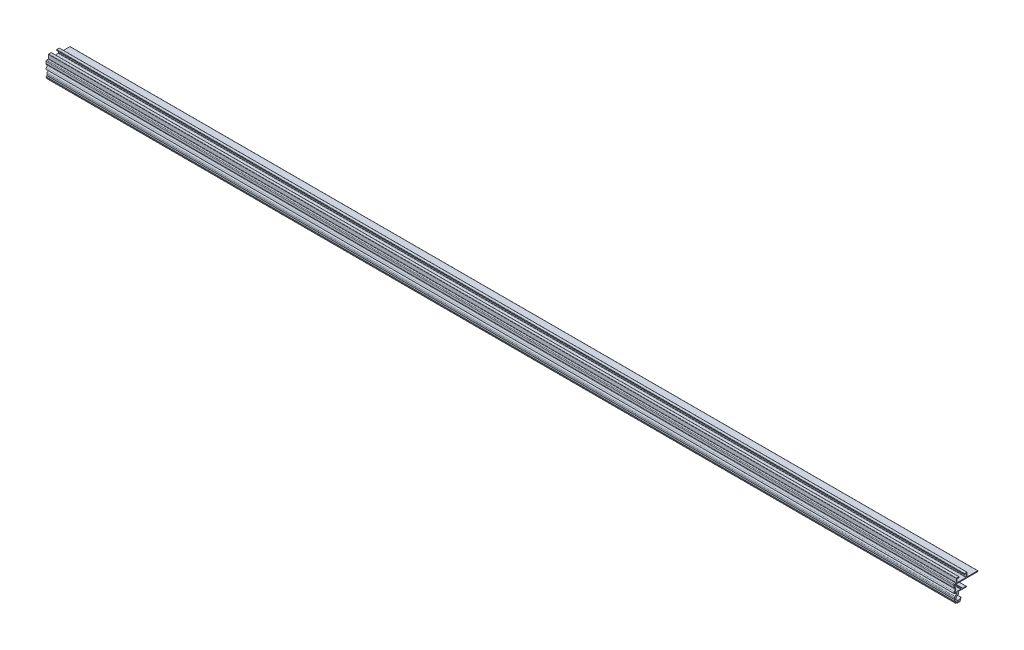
from build123d import *

# Parameters (mm, degrees)
BOSS_EXTRU_1_DEPTH = 1087


with BuildPart() as part:
    # Esquisse1 → Boss.-Extru.1 (new body)
    with BuildSketch(Plane(origin=(0, 0, 0), x_dir=(0, 0, -1), z_dir=(1, 0, 0))):
        with BuildLine():
            Line((11.5, -12.657081), (11.5, -12.857081))
            ThreePointArc((11.5, -12.857081), (11.382842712, -13.139923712), (11.1, -13.257081))
            Line((11.1, -13.257081), (2, -13.257081))
            Line((2, -13.257081), (2, -16.408499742))
            ThreePointArc((2, -16.408499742), (-0.258474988, -20.871875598), (4.717577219, -20.360663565))
            ThreePointArc((4.717577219, -20.360663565), (4.819997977, -20.299909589), (4.907922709, -20.380223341))
            Line((4.907922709, -20.380223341), (5.057433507, -21.145993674))
            Line((5.057433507, -21.145993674), (4.450801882, -22.977983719))
            Line((4.450801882, -22.977983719), (3.699511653, -24.650639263))
            ThreePointArc((3.699511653, -24.650639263), (3.646762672, -24.720942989), (3.568966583, -24.761843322))
            ThreePointArc((3.568966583, -24.761843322), (3.398359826, -24.804870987), (3.226506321, -24.842612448))
            ThreePointArc((3.226506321, -24.842612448), (3.177526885, -24.852355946), (3.128463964, -24.861669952))
            ThreePointArc((3.128463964, -24.861669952), (2.929246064, -24.838283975), (2.788874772, -24.694999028))
            Line((2.788874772, -24.694999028), (2.318713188, -23.686838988))
            ThreePointArc((2.318713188, -23.686838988), (2.300657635, -23.662999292), (2.272225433, -23.653728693))
            ThreePointArc((2.272225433, -23.653728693), (2.180779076, -23.656568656), (2.089293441, -23.657506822))
            ThreePointArc((2.089293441, -23.657506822), (1.992617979, -23.656431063), (1.895989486, -23.653231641))
            ThreePointArc((1.895989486, -23.653231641), (1.867956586, -23.660484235), (1.848644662, -23.682059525))
            Line((1.848644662, -23.682059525), (1.376299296, -24.695007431))
            ThreePointArc((1.376299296, -24.695007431), (1.242087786, -24.833486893), (1.051311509, -24.861659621))
            ThreePointArc((1.051311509, -24.861659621), (1.002248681, -24.852345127), (0.953269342, -24.842601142))
            ThreePointArc((0.953269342, -24.842601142), (0.77731922, -24.746287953), (0.700846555, -24.560851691))
            Line((0.700846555, -24.560851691), (0.642594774, -23.449975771))
            ThreePointArc((0.642594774, -23.449975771), (0.63478475, -23.421108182), (0.611895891, -23.401861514))
            ThreePointArc((0.611895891, -23.401861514), (0.526044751, -23.37023742), (0.440869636, -23.336835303))
            ThreePointArc((0.440869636, -23.336835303), (0.35417244, -23.300710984), (0.26826598, -23.262744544))
            ThreePointArc((0.26826598, -23.262744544), (0.236328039, -23.257909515), (0.207864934, -23.27318241))
            Line((0.207864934, -23.27318241), (-0.609543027, -24.035427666))
            ThreePointArc((-0.609543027, -24.035427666), (-0.786172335, -24.111350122), (-0.972621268, -24.064457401))
            ThreePointArc((-0.972621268, -24.064457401), (-1.014621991, -24.037441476), (-1.05638441, -24.010058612))
            ThreePointArc((-1.05638441, -24.010058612), (-1.183441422, -23.854845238), (-1.184878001, -23.654264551))
            Line((-1.184878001, -23.654264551), (-0.822736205, -22.602460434))
            ThreePointArc((-0.822736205, -22.602460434), (-0.819163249, -22.572769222), (-0.833175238, -22.546349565))
            ThreePointArc((-0.833175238, -22.546349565), (-0.900927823, -22.484867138), (-0.967387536, -22.421989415))
            ThreePointArc((-0.967387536, -22.421989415), (-1.035043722, -22.355205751), (-1.101241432, -22.286976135))
            ThreePointArc((-1.101241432, -22.286976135), (-1.129574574, -22.273956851), (-1.160271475, -22.279431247))
            Line((-1.160271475, -22.279431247), (-2.203701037, -22.679966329))
            ThreePointArc((-2.203701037, -22.679966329), (-2.396233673, -22.682296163), (-2.55052696, -22.567110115))
            ThreePointArc((-2.55052696, -22.567110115), (-2.579348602, -22.526327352), (-2.607811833, -22.485293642))
            ThreePointArc((-2.607811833, -22.485293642), (-2.667471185, -22.29378532), (-2.593662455, -22.107272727))
            Line((-2.593662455, -22.107272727), (-1.863869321, -21.267724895))
            ThreePointArc((-1.863869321, -21.267724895), (-1.849433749, -21.241534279), (-1.852528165, -21.211789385))
            ThreePointArc((-1.852528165, -21.211789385), (-1.892314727, -21.129402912), (-1.930379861, -21.046207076))
            ThreePointArc((-1.930379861, -21.046207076), (-1.966617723, -20.962450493), (-2.00111087, -20.877960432))
            ThreePointArc((-2.00111087, -20.877960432), (-2.02385699, -20.855284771), (-2.055516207, -20.84987501))
            Line((-2.055516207, -20.84987501), (-3.173010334, -20.830369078))
            ThreePointArc((-3.173010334, -20.830369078), (-3.355364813, -20.764529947), (-3.459373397, -20.60091405))
            ThreePointArc((-3.459373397, -20.60091405), (-3.473429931, -20.541480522), (-3.486849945, -20.481900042))
            ThreePointArc((-3.486849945, -20.481900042), (-3.465092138, -20.289248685), (-3.330054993, -20.150133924))
            Line((-3.330054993, -20.150133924), (-2.334208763, -19.642724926))
            ThreePointArc((-2.334208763, -19.642724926), (-2.30812513, -19.623984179), (-2.297621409, -19.593632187))
            ThreePointArc((-2.297621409, -19.593632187), (-2.303657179, -19.502572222), (-2.307803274, -19.411406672))
            Line((-2.307803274, -19.411406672), (-2.433175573, -17.600837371))
            ThreePointArc((-2.433175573, -17.600837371), (-2.363299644, -16.92134606), (-2.068836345, -16.305000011))
            ThreePointArc((-2.068836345, -16.305000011), (-1.147984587, -15.316776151), (0, -14.604957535))
            Line((0, -14.604957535), (0, -13.257081))
            Line((0, -13.257081), (-2.17427323, -13.257081))
            ThreePointArc((-2.17427323, -13.257081), (-3.436549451, -12.33658282), (-2.945941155, -10.853356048))
            ThreePointArc((-2.945941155, -10.853356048), (-2.110084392, -9.226968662), (-2.946123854, -7.600675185))
            ThreePointArc((-2.946123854, -7.600675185), (-3.353423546, -7.128939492), (-3.5, -6.523181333))
            Line((-3.5, -6.523181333), (-3.5, -4.057081))
            ThreePointArc((-3.5, -4.057081), (-3.265685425, -3.491395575), (-2.7, -3.257081))
            Line((-2.7, -3.257081), (-0.809769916, -3.257081))
            ThreePointArc((-0.809769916, -3.257081), (-0.590729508, -3.166351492), (-0.5, -2.947311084))
            Line((-0.5, -2.947311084), (-0.5, 1.433149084))
            ThreePointArc((-0.5, 1.433149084), (-0.409270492, 1.652189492), (-0.190230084, 1.742919))
            Line((-0.190230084, 1.742919), (2.690230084, 1.742919))
            ThreePointArc((2.690230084, 1.742919), (2.909270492, 1.652189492), (3, 1.433149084))
            Line((3, 1.433149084), (3, 1.052688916))
            ThreePointArc((3, 1.052688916), (2.909270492, 0.833648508), (2.690230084, 0.742919))
            Line((2.690230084, 0.742919), (0.809769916, 0.742919))
            ThreePointArc((0.809769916, 0.742919), (0.590729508, 0.652189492), (0.5, 0.433149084))
            Line((0.5, 0.433149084), (0.5, -2.947311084))
            ThreePointArc((0.5, -2.947311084), (0.590729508, -3.166351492), (0.809769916, -3.257081))
            Line((0.809769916, -3.257081), (11.190230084, -3.257081))
            ThreePointArc((11.190230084, -3.257081), (11.409270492, -3.166351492), (11.5, -2.947311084))
            Line((11.5, -2.947311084), (11.5, 0.433149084))
            ThreePointArc((11.5, 0.433149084), (11.409270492, 0.652189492), (11.190230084, 0.742919))
            Line((11.190230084, 0.742919), (9.309769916, 0.742919))
            ThreePointArc((9.309769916, 0.742919), (9.090729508, 0.833648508), (9, 1.052688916))
            Line((9, 1.052688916), (9, 1.433149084))
            ThreePointArc((9, 1.433149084), (9.090729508, 1.652189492), (9.309769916, 1.742919))
            Line((9.309769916, 1.742919), (12.190230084, 1.742919))
            ThreePointArc((12.190230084, 1.742919), (12.409270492, 1.652189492), (12.5, 1.433149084))
            Line((12.5, 1.433149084), (12.5, -2.947311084))
            ThreePointArc((12.5, -2.947311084), (12.590729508, -3.166351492), (12.809769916, -3.257081))
            Line((12.809769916, -3.257081), (25.1, -3.257081))
            ThreePointArc((25.1, -3.257081), (25.382842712, -3.374238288), (25.5, -3.657081))
            Line((25.5, -3.657081), (25.5, -3.857081))
            ThreePointArc((25.5, -3.857081), (25.382842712, -4.139923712), (25.1, -4.257081))
            Line((25.1, -4.257081), (-0.5, -4.257081))
            Line((-0.5, -4.257081), (-2.3, -4.257081))
            ThreePointArc((-2.3, -4.257081), (-2.441421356, -4.315659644), (-2.5, -4.457081))
            Line((-2.5, -4.457081), (-2.5, -6.489972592))
            ThreePointArc((-2.5, -6.489972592), (-2.457734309, -6.666553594), (-2.340098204, -6.80486117))
            ThreePointArc((-2.340098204, -6.80486117), (-1.110958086, -9.154683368), (-2.225285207, -11.561075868))
            ThreePointArc((-2.225285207, -11.561075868), (-2.348437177, -11.996046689), (-1.979347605, -12.257081))
            Line((-1.979347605, -12.257081), (4.620101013, -12.257081))
            ThreePointArc((4.620101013, -12.257081), (4.989652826, -12.010154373), (4.902943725, -11.574238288))
            Line((4.902943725, -11.574238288), (2.333095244, -9.004389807))
            ThreePointArc((2.333095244, -9.004389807), (2.215937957, -8.721547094), (2.333095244, -8.438704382))
            Line((2.333095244, -8.438704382), (2.4745166, -8.297283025))
            ThreePointArc((2.4745166, -8.297283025), (2.757359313, -8.180125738), (3.040202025, -8.297283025))
            Line((3.040202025, -8.297283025), (6.882842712, -12.139923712))
            ThreePointArc((6.882842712, -12.139923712), (7.012612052, -12.226632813), (7.165685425, -12.257081))
            Line((7.165685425, -12.257081), (11.1, -12.257081))
            ThreePointArc((11.1, -12.257081), (11.382842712, -12.374238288), (11.5, -12.657081))
        make_face()
    extrude(amount=BOSS_EXTRU_1_DEPTH)


solid = part.part
